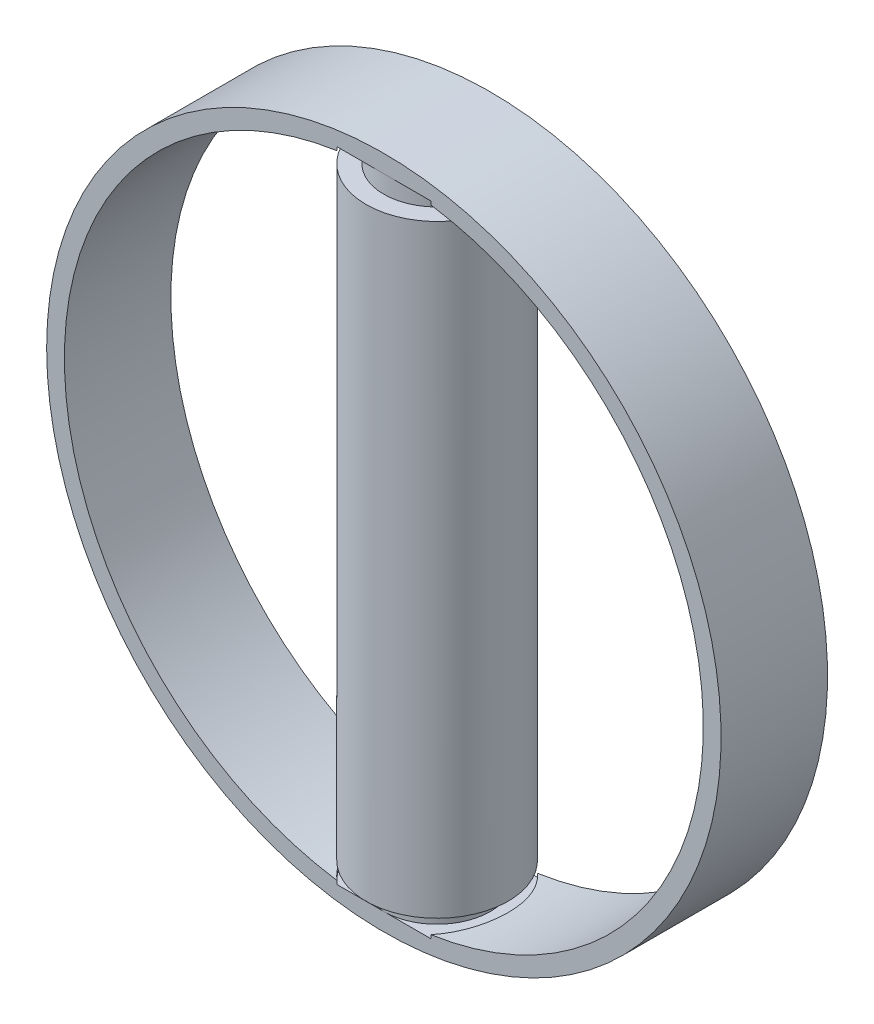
from build123d import *

# Parameters (mm, degrees)
SKETCH1_R           = 12.7
BOSS_EXTRUDE1_DEPTH = 114.3
SKETCH2_R           = 60.325
SKETCH2_R_2         = 57.15
BOSS_EXTRUDE2_DEPTH = 9.525
CUT_EXTRUDE1_START  = -3.175
SKETCH3_R           = 12.7
SKETCH3_R_2         = 9.525
CUT_EXTRUDE1_DEPTH  = 3.175
SKETCH4_R           = 12.7
SKETCH4_R_2         = 9.525
CUT_EXTRUDE2_DEPTH  = 3.175


with BuildPart() as part:
    # Sketch1 → Boss-Extrude1 (new body)
    with BuildSketch(Plane(origin=(0, 0, 0), x_dir=(1, 0, 0), z_dir=(0, 1, 0))):
        with Locations(Location((0, 0, 0), (0, 0, 270))):
            Circle(SKETCH1_R)
    extrude(amount=BOSS_EXTRUDE1_DEPTH)

    # Sketch2 → Boss-Extrude2 (add, symmetric)
    with BuildSketch(Plane.XY):
        with Locations(Location((0, 57.15, 0), (0, 0, 180))):
            Circle(SKETCH2_R)
        with Locations((0, 57.15)):
            Circle(SKETCH2_R_2, mode=Mode.SUBTRACT)
    extrude(amount=BOSS_EXTRUDE2_DEPTH, both=True)

    # Sketch3 → Cut-Extrude1 (cut)
    with BuildSketch(Plane(origin=(0, 114.3, 0), x_dir=(1, 0, 0), z_dir=(0, 1, 0)).offset(CUT_EXTRUDE1_START)):
        with Locations(Location((0, 0, 0), (0, 0, 48.590377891))):
            Circle(SKETCH3_R)
        with Locations(Location((0, 0, 0), (0, 0, 270))):
            Circle(SKETCH3_R_2, mode=Mode.SUBTRACT)
    extrude(amount=CUT_EXTRUDE1_DEPTH, mode=Mode.SUBTRACT)

    # Sketch4 → Cut-Extrude2 (cut)
    with BuildSketch(Plane.XZ):
        with Locations(Location((0, 0, 0), (0, 0, 270))):
            Circle(SKETCH4_R)
        with Locations(Location((0, 0, 0), (0, 0, 90))):
            Circle(SKETCH4_R_2, mode=Mode.SUBTRACT)
    extrude(amount=-CUT_EXTRUDE2_DEPTH, mode=Mode.SUBTRACT)


solid = part.part
